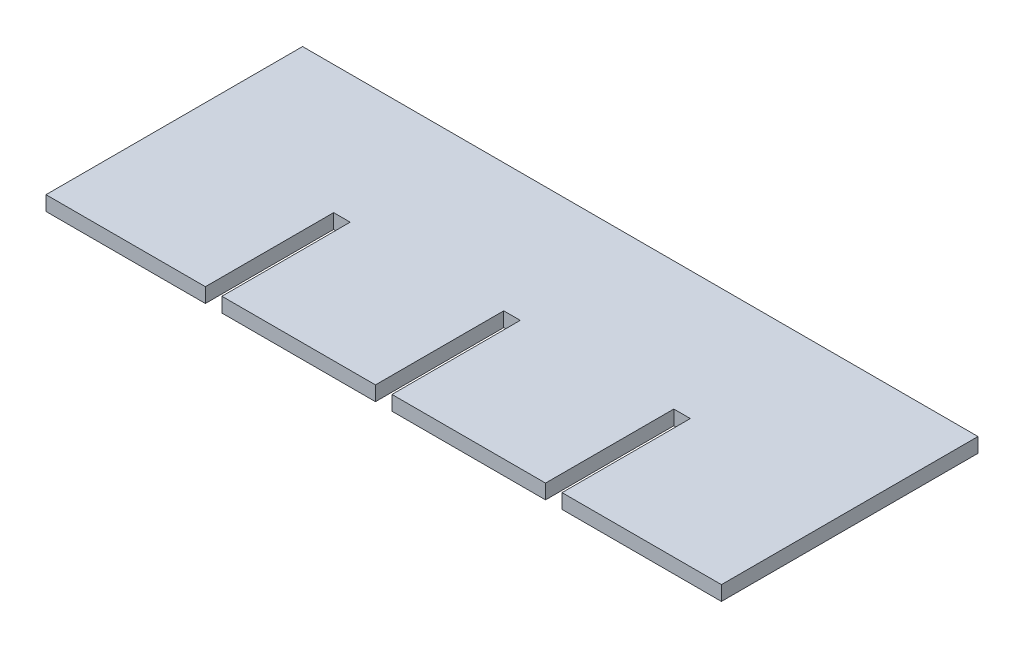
ISO-10303-21;
HEADER;
FILE_DESCRIPTION(('STEP AP214'),'2;1');
FILE_NAME('part.step','',(''),(''),'','','');
FILE_SCHEMA(('AUTOMOTIVE_DESIGN { 1 0 10303 214 1 1 1 1 }'));
ENDSEC;
DATA;
#1=APPLICATION_CONTEXT('core data for automotive mechanical design processes');
#2=APPLICATION_PROTOCOL_DEFINITION('international standard','automotive_design',2000,#1);
#3=PRODUCT_CONTEXT('',#1,'mechanical');
#4=PRODUCT('Part','Part','',(#3));
#5=PRODUCT_RELATED_PRODUCT_CATEGORY('part','',(#4));
#6=PRODUCT_DEFINITION_FORMATION('','',#4);
#7=PRODUCT_DEFINITION_CONTEXT('part definition',#1,'design');
#8=PRODUCT_DEFINITION('design','',#6,#7);
#9=PRODUCT_DEFINITION_SHAPE('','',#8);
#10=(LENGTH_UNIT() NAMED_UNIT(*) SI_UNIT(.MILLI.,.METRE.));
#11=(NAMED_UNIT(*) PLANE_ANGLE_UNIT() SI_UNIT($,.RADIAN.));
#12=(NAMED_UNIT(*) SI_UNIT($,.STERADIAN.) SOLID_ANGLE_UNIT());
#13=UNCERTAINTY_MEASURE_WITH_UNIT(LENGTH_MEASURE(1.E-05),#10,'distance_accuracy_value','');
#14=(GEOMETRIC_REPRESENTATION_CONTEXT(3) GLOBAL_UNCERTAINTY_ASSIGNED_CONTEXT((#13)) GLOBAL_UNIT_ASSIGNED_CONTEXT((#10,
#11,#12)) REPRESENTATION_CONTEXT('',''));
#15=CARTESIAN_POINT('',(0.,0.,0.));
#16=DIRECTION('',(0.,0.,1.));
#17=DIRECTION('',(1.,0.,0.));
#18=AXIS2_PLACEMENT_3D('',#15,#16,#17);
#19=CARTESIAN_POINT('',(0.,0.,26.4));
#20=DIRECTION('',(0.,0.,-1.));
#21=DIRECTION('',(-1.,0.,0.));
#22=AXIS2_PLACEMENT_3D('',#19,#20,#21);
#23=PLANE('',#22);
#24=DIRECTION('',(-1.,0.,0.));
#25=VECTOR('',#24,1.);
#26=CARTESIAN_POINT('',(-34.75,-19.25,26.4));
#27=LINE('',#26,#25);
#28=CARTESIAN_POINT('',(16.65,-19.25,26.4));
#29=VERTEX_POINT('',#28);
#30=CARTESIAN_POINT('',(0.849999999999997,-19.25,26.4));
#31=VERTEX_POINT('',#30);
#32=EDGE_CURVE('E162',#29,#31,#27,.T.);
#33=ORIENTED_EDGE('',*,*,#32,.T.);
#34=DIRECTION('',(0.,-1.,0.));
#35=VECTOR('',#34,1.);
#36=CARTESIAN_POINT('',(0.849999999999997,-5.94098050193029,26.4));
#37=LINE('',#36,#35);
#38=CARTESIAN_POINT('',(0.849999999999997,-20.75,26.4));
#39=VERTEX_POINT('',#38);
#40=EDGE_CURVE('E151',#31,#39,#37,.T.);
#41=ORIENTED_EDGE('',*,*,#40,.T.);
#42=DIRECTION('',(1.,0.,0.));
#43=VECTOR('',#42,1.);
#44=CARTESIAN_POINT('',(-34.75,-20.75,26.4));
#45=LINE('',#44,#43);
#46=CARTESIAN_POINT('',(16.65,-20.75,26.4));
#47=VERTEX_POINT('',#46);
#48=EDGE_CURVE('E57',#39,#47,#45,.T.);
#49=ORIENTED_EDGE('',*,*,#48,.T.);
#50=DIRECTION('',(0.,-1.,0.));
#51=VECTOR('',#50,1.);
#52=CARTESIAN_POINT('',(16.65,-5.94098050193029,26.4));
#53=LINE('',#52,#51);
#54=EDGE_CURVE('E295',#29,#47,#53,.T.);
#55=ORIENTED_EDGE('',*,*,#54,.F.);
#56=EDGE_LOOP('',(#33,#41,#49,#55));
#57=FACE_BOUND('',#56,.T.);
#58=ADVANCED_FACE('F34',(#57),#23,.F.);
#59=CARTESIAN_POINT('',(34.75,-19.25,26.4));
#60=VERTEX_POINT('',#59);
#61=CARTESIAN_POINT('',(18.35,-19.25,26.4));
#62=VERTEX_POINT('',#61);
#63=EDGE_CURVE('E222',#60,#62,#27,.T.);
#64=ORIENTED_EDGE('',*,*,#63,.T.);
#65=DIRECTION('',(0.,-1.,0.));
#66=VECTOR('',#65,1.);
#67=CARTESIAN_POINT('',(18.35,-5.94098050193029,26.4));
#68=LINE('',#67,#66);
#69=CARTESIAN_POINT('',(18.35,-20.75,26.4));
#70=VERTEX_POINT('',#69);
#71=EDGE_CURVE('E291',#62,#70,#68,.T.);
#72=ORIENTED_EDGE('',*,*,#71,.T.);
#73=CARTESIAN_POINT('',(34.75,-20.75,26.4));
#74=VERTEX_POINT('',#73);
#75=EDGE_CURVE('E171',#70,#74,#45,.T.);
#76=ORIENTED_EDGE('',*,*,#75,.T.);
#77=DIRECTION('',(0.,1.,0.));
#78=VECTOR('',#77,1.);
#79=CARTESIAN_POINT('',(34.75,-19.25,26.4));
#80=LINE('',#79,#78);
#81=EDGE_CURVE('E179',#74,#60,#80,.T.);
#82=ORIENTED_EDGE('',*,*,#81,.T.);
#83=EDGE_LOOP('',(#64,#72,#76,#82));
#84=FACE_BOUND('',#83,.T.);
#85=ADVANCED_FACE('F242',(#84),#23,.F.);
#86=CARTESIAN_POINT('',(-16.65,-20.75,26.4));
#87=VERTEX_POINT('',#86);
#88=CARTESIAN_POINT('',(-0.850000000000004,-20.75,26.4));
#89=VERTEX_POINT('',#88);
#90=EDGE_CURVE('E170',#87,#89,#45,.T.);
#91=ORIENTED_EDGE('',*,*,#90,.T.);
#92=DIRECTION('',(0.,-1.,0.));
#93=VECTOR('',#92,1.);
#94=CARTESIAN_POINT('',(-0.850000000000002,-5.94098050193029,26.4));
#95=LINE('',#94,#93);
#96=CARTESIAN_POINT('',(-0.850000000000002,-19.25,26.4));
#97=VERTEX_POINT('',#96);
#98=EDGE_CURVE('E49',#97,#89,#95,.T.);
#99=ORIENTED_EDGE('',*,*,#98,.F.);
#100=CARTESIAN_POINT('',(-16.65,-19.25,26.4));
#101=VERTEX_POINT('',#100);
#102=EDGE_CURVE('E227',#97,#101,#27,.T.);
#103=ORIENTED_EDGE('',*,*,#102,.T.);
#104=DIRECTION('',(0.,-1.,0.));
#105=VECTOR('',#104,1.);
#106=CARTESIAN_POINT('',(-16.65,-5.94098050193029,26.4));
#107=LINE('',#106,#105);
#108=EDGE_CURVE('E264',#101,#87,#107,.T.);
#109=ORIENTED_EDGE('',*,*,#108,.T.);
#110=EDGE_LOOP('',(#91,#99,#103,#109));
#111=FACE_BOUND('',#110,.T.);
#112=ADVANCED_FACE('F240',(#111),#23,.F.);
#113=CARTESIAN_POINT('',(-34.75,-19.25,26.4));
#114=DIRECTION('',(0.,-1.,0.));
#115=DIRECTION('',(0.,0.,-1.));
#116=AXIS2_PLACEMENT_3D('',#113,#114,#115);
#117=PLANE('',#116);
#118=DIRECTION('',(-1.,0.,0.));
#119=VECTOR('',#118,1.);
#120=CARTESIAN_POINT('',(0.85,-19.25,13.2));
#121=LINE('',#120,#119);
#122=CARTESIAN_POINT('',(0.85,-19.25,13.2));
#123=VERTEX_POINT('',#122);
#124=CARTESIAN_POINT('',(-0.85,-19.25,13.2));
#125=VERTEX_POINT('',#124);
#126=EDGE_CURVE('E354',#123,#125,#121,.T.);
#127=ORIENTED_EDGE('',*,*,#126,.F.);
#128=DIRECTION('',(0.,0.,-1.));
#129=VECTOR('',#128,1.);
#130=CARTESIAN_POINT('',(0.849999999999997,-19.25,26.4));
#131=LINE('',#130,#129);
#132=EDGE_CURVE('E286',#31,#123,#131,.T.);
#133=ORIENTED_EDGE('',*,*,#132,.F.);
#134=ORIENTED_EDGE('',*,*,#32,.F.);
#135=DIRECTION('',(0.,0.,1.));
#136=VECTOR('',#135,1.);
#137=CARTESIAN_POINT('',(16.65,-19.25,26.4));
#138=LINE('',#137,#136);
#139=CARTESIAN_POINT('',(16.65,-19.25,13.2));
#140=VERTEX_POINT('',#139);
#141=EDGE_CURVE('E278',#140,#29,#138,.T.);
#142=ORIENTED_EDGE('',*,*,#141,.F.);
#143=DIRECTION('',(-1.,0.,0.));
#144=VECTOR('',#143,1.);
#145=CARTESIAN_POINT('',(18.35,-19.25,13.2));
#146=LINE('',#145,#144);
#147=CARTESIAN_POINT('',(18.35,-19.25,13.2));
#148=VERTEX_POINT('',#147);
#149=EDGE_CURVE('E280',#148,#140,#146,.T.);
#150=ORIENTED_EDGE('',*,*,#149,.F.);
#151=DIRECTION('',(0.,0.,-1.));
#152=VECTOR('',#151,1.);
#153=CARTESIAN_POINT('',(18.35,-19.25,26.4));
#154=LINE('',#153,#152);
#155=EDGE_CURVE('E224',#62,#148,#154,.T.);
#156=ORIENTED_EDGE('',*,*,#155,.F.);
#157=ORIENTED_EDGE('',*,*,#63,.F.);
#158=DIRECTION('',(0.,0.,-1.));
#159=VECTOR('',#158,1.);
#160=CARTESIAN_POINT('',(34.75,-19.25,26.4));
#161=LINE('',#160,#159);
#162=CARTESIAN_POINT('',(34.75,-19.25,0.));
#163=VERTEX_POINT('',#162);
#164=EDGE_CURVE('E183',#60,#163,#161,.T.);
#165=ORIENTED_EDGE('',*,*,#164,.T.);
#166=DIRECTION('',(-1.,0.,0.));
#167=VECTOR('',#166,1.);
#168=CARTESIAN_POINT('',(-34.75,-19.25,0.));
#169=LINE('',#168,#167);
#170=CARTESIAN_POINT('',(-34.75,-19.25,0.));
#171=VERTEX_POINT('',#170);
#172=EDGE_CURVE('E192',#163,#171,#169,.T.);
#173=ORIENTED_EDGE('',*,*,#172,.T.);
#174=DIRECTION('',(0.,0.,-1.));
#175=VECTOR('',#174,1.);
#176=CARTESIAN_POINT('',(-34.75,-19.25,26.4));
#177=LINE('',#176,#175);
#178=CARTESIAN_POINT('',(-34.75,-19.25,26.4));
#179=VERTEX_POINT('',#178);
#180=EDGE_CURVE('E11',#179,#171,#177,.T.);
#181=ORIENTED_EDGE('',*,*,#180,.F.);
#182=CARTESIAN_POINT('',(-18.35,-19.25,26.4));
#183=VERTEX_POINT('',#182);
#184=EDGE_CURVE('E201',#183,#179,#27,.T.);
#185=ORIENTED_EDGE('',*,*,#184,.F.);
#186=DIRECTION('',(0.,0.,1.));
#187=VECTOR('',#186,1.);
#188=CARTESIAN_POINT('',(-18.35,-19.25,13.2));
#189=LINE('',#188,#187);
#190=CARTESIAN_POINT('',(-18.35,-19.25,13.2));
#191=VERTEX_POINT('',#190);
#192=EDGE_CURVE('E298',#191,#183,#189,.T.);
#193=ORIENTED_EDGE('',*,*,#192,.F.);
#194=DIRECTION('',(-1.,0.,0.));
#195=VECTOR('',#194,1.);
#196=CARTESIAN_POINT('',(-18.35,-19.25,13.2));
#197=LINE('',#196,#195);
#198=CARTESIAN_POINT('',(-16.65,-19.25,13.2));
#199=VERTEX_POINT('',#198);
#200=EDGE_CURVE('E300',#199,#191,#197,.T.);
#201=ORIENTED_EDGE('',*,*,#200,.F.);
#202=DIRECTION('',(0.,0.,-1.));
#203=VECTOR('',#202,1.);
#204=CARTESIAN_POINT('',(-16.65,-19.25,13.2));
#205=LINE('',#204,#203);
#206=EDGE_CURVE('E196',#101,#199,#205,.T.);
#207=ORIENTED_EDGE('',*,*,#206,.F.);
#208=ORIENTED_EDGE('',*,*,#102,.F.);
#209=DIRECTION('',(0.,0.,1.));
#210=VECTOR('',#209,1.);
#211=CARTESIAN_POINT('',(-0.850000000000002,-19.25,26.4));
#212=LINE('',#211,#210);
#213=EDGE_CURVE('E274',#125,#97,#212,.T.);
#214=ORIENTED_EDGE('',*,*,#213,.F.);
#215=EDGE_LOOP('',(#127,#133,#134,#142,#150,#156,#157,#165,#173,#181,#185,#193,#201,#207,#208,#214));
#216=FACE_BOUND('',#215,.T.);
#217=ADVANCED_FACE('F36',(#216),#117,.F.);
#218=CARTESIAN_POINT('',(-34.75,-19.25,26.4));
#219=DIRECTION('',(1.,0.,0.));
#220=DIRECTION('',(0.,0.,-1.));
#221=AXIS2_PLACEMENT_3D('',#218,#219,#220);
#222=PLANE('',#221);
#223=DIRECTION('',(0.,-1.,0.));
#224=VECTOR('',#223,1.);
#225=CARTESIAN_POINT('',(-34.75,-19.25,0.));
#226=LINE('',#225,#224);
#227=CARTESIAN_POINT('',(-34.75,-20.75,0.));
#228=VERTEX_POINT('',#227);
#229=EDGE_CURVE('E195',#171,#228,#226,.T.);
#230=ORIENTED_EDGE('',*,*,#229,.T.);
#231=DIRECTION('',(0.,0.,-1.));
#232=VECTOR('',#231,1.);
#233=CARTESIAN_POINT('',(-34.75,-20.75,26.4));
#234=LINE('',#233,#232);
#235=CARTESIAN_POINT('',(-34.75,-20.75,26.4));
#236=VERTEX_POINT('',#235);
#237=EDGE_CURVE('E42',#236,#228,#234,.T.);
#238=ORIENTED_EDGE('',*,*,#237,.F.);
#239=DIRECTION('',(0.,-1.,0.));
#240=VECTOR('',#239,1.);
#241=CARTESIAN_POINT('',(-34.75,-19.25,26.4));
#242=LINE('',#241,#240);
#243=EDGE_CURVE('E175',#179,#236,#242,.T.);
#244=ORIENTED_EDGE('',*,*,#243,.F.);
#245=ORIENTED_EDGE('',*,*,#180,.T.);
#246=EDGE_LOOP('',(#230,#238,#244,#245));
#247=FACE_BOUND('',#246,.T.);
#248=ADVANCED_FACE('F233',(#247),#222,.F.);
#249=CARTESIAN_POINT('',(-34.75,-20.75,26.4));
#250=DIRECTION('',(0.,1.,0.));
#251=DIRECTION('',(0.,0.,1.));
#252=AXIS2_PLACEMENT_3D('',#249,#250,#251);
#253=PLANE('',#252);
#254=ORIENTED_EDGE('',*,*,#48,.F.);
#255=DIRECTION('',(0.,0.,1.));
#256=VECTOR('',#255,1.);
#257=CARTESIAN_POINT('',(0.849999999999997,-20.75,26.4));
#258=LINE('',#257,#256);
#259=CARTESIAN_POINT('',(0.85,-20.75,13.2));
#260=VERTEX_POINT('',#259);
#261=EDGE_CURVE('E149',#260,#39,#258,.T.);
#262=ORIENTED_EDGE('',*,*,#261,.F.);
#263=DIRECTION('',(1.,0.,0.));
#264=VECTOR('',#263,1.);
#265=CARTESIAN_POINT('',(0.85,-20.75,13.2));
#266=LINE('',#265,#264);
#267=CARTESIAN_POINT('',(-0.85,-20.75,13.2));
#268=VERTEX_POINT('',#267);
#269=EDGE_CURVE('E163',#268,#260,#266,.T.);
#270=ORIENTED_EDGE('',*,*,#269,.F.);
#271=DIRECTION('',(0.,0.,-1.));
#272=VECTOR('',#271,1.);
#273=CARTESIAN_POINT('',(-0.850000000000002,-20.75,26.4));
#274=LINE('',#273,#272);
#275=EDGE_CURVE('E158',#89,#268,#274,.T.);
#276=ORIENTED_EDGE('',*,*,#275,.F.);
#277=ORIENTED_EDGE('',*,*,#90,.F.);
#278=DIRECTION('',(0.,0.,1.));
#279=VECTOR('',#278,1.);
#280=CARTESIAN_POINT('',(-16.65,-20.75,13.2));
#281=LINE('',#280,#279);
#282=CARTESIAN_POINT('',(-16.65,-20.75,13.2));
#283=VERTEX_POINT('',#282);
#284=EDGE_CURVE('E267',#283,#87,#281,.T.);
#285=ORIENTED_EDGE('',*,*,#284,.F.);
#286=DIRECTION('',(1.,0.,0.));
#287=VECTOR('',#286,1.);
#288=CARTESIAN_POINT('',(-18.35,-20.75,13.2));
#289=LINE('',#288,#287);
#290=CARTESIAN_POINT('',(-18.35,-20.75,13.2));
#291=VERTEX_POINT('',#290);
#292=EDGE_CURVE('E308',#291,#283,#289,.T.);
#293=ORIENTED_EDGE('',*,*,#292,.F.);
#294=DIRECTION('',(0.,0.,-1.));
#295=VECTOR('',#294,1.);
#296=CARTESIAN_POINT('',(-18.35,-20.75,13.2));
#297=LINE('',#296,#295);
#298=CARTESIAN_POINT('',(-18.35,-20.75,26.4));
#299=VERTEX_POINT('',#298);
#300=EDGE_CURVE('E305',#299,#291,#297,.T.);
#301=ORIENTED_EDGE('',*,*,#300,.F.);
#302=EDGE_CURVE('E173',#236,#299,#45,.T.);
#303=ORIENTED_EDGE('',*,*,#302,.F.);
#304=ORIENTED_EDGE('',*,*,#237,.T.);
#305=DIRECTION('',(1.,0.,0.));
#306=VECTOR('',#305,1.);
#307=CARTESIAN_POINT('',(-34.75,-20.75,0.));
#308=LINE('',#307,#306);
#309=CARTESIAN_POINT('',(34.75,-20.75,0.));
#310=VERTEX_POINT('',#309);
#311=EDGE_CURVE('E198',#228,#310,#308,.T.);
#312=ORIENTED_EDGE('',*,*,#311,.T.);
#313=DIRECTION('',(0.,0.,-1.));
#314=VECTOR('',#313,1.);
#315=CARTESIAN_POINT('',(34.75,-20.75,26.4));
#316=LINE('',#315,#314);
#317=EDGE_CURVE('E189',#74,#310,#316,.T.);
#318=ORIENTED_EDGE('',*,*,#317,.F.);
#319=ORIENTED_EDGE('',*,*,#75,.F.);
#320=DIRECTION('',(0.,0.,1.));
#321=VECTOR('',#320,1.);
#322=CARTESIAN_POINT('',(18.35,-20.75,26.4));
#323=LINE('',#322,#321);
#324=CARTESIAN_POINT('',(18.35,-20.75,13.2));
#325=VERTEX_POINT('',#324);
#326=EDGE_CURVE('E284',#325,#70,#323,.T.);
#327=ORIENTED_EDGE('',*,*,#326,.F.);
#328=DIRECTION('',(1.,0.,0.));
#329=VECTOR('',#328,1.);
#330=CARTESIAN_POINT('',(18.35,-20.75,13.2));
#331=LINE('',#330,#329);
#332=CARTESIAN_POINT('',(16.65,-20.75,13.2));
#333=VERTEX_POINT('',#332);
#334=EDGE_CURVE('E288',#333,#325,#331,.T.);
#335=ORIENTED_EDGE('',*,*,#334,.F.);
#336=DIRECTION('',(0.,0.,-1.));
#337=VECTOR('',#336,1.);
#338=CARTESIAN_POINT('',(16.65,-20.75,26.4));
#339=LINE('',#338,#337);
#340=EDGE_CURVE('E169',#47,#333,#339,.T.);
#341=ORIENTED_EDGE('',*,*,#340,.F.);
#342=EDGE_LOOP('',(#254,#262,#270,#276,#277,#285,#293,#301,#303,#304,#312,#318,#319,#327,#335,#341));
#343=FACE_BOUND('',#342,.T.);
#344=ADVANCED_FACE('F166',(#343),#253,.F.);
#345=CARTESIAN_POINT('',(34.75,-19.25,26.4));
#346=DIRECTION('',(-1.,0.,0.));
#347=DIRECTION('',(0.,-1.,0.));
#348=AXIS2_PLACEMENT_3D('',#345,#346,#347);
#349=PLANE('',#348);
#350=DIRECTION('',(0.,1.,0.));
#351=VECTOR('',#350,1.);
#352=CARTESIAN_POINT('',(34.75,-19.25,0.));
#353=LINE('',#352,#351);
#354=EDGE_CURVE('E200',#310,#163,#353,.T.);
#355=ORIENTED_EDGE('',*,*,#354,.T.);
#356=ORIENTED_EDGE('',*,*,#164,.F.);
#357=ORIENTED_EDGE('',*,*,#81,.F.);
#358=ORIENTED_EDGE('',*,*,#317,.T.);
#359=EDGE_LOOP('',(#355,#356,#357,#358));
#360=FACE_BOUND('',#359,.T.);
#361=ADVANCED_FACE('F216',(#360),#349,.F.);
#362=ORIENTED_EDGE('',*,*,#302,.T.);
#363=DIRECTION('',(0.,-1.,0.));
#364=VECTOR('',#363,1.);
#365=CARTESIAN_POINT('',(-18.35,-5.94098050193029,26.4));
#366=LINE('',#365,#364);
#367=EDGE_CURVE('E231',#183,#299,#366,.T.);
#368=ORIENTED_EDGE('',*,*,#367,.F.);
#369=ORIENTED_EDGE('',*,*,#184,.T.);
#370=ORIENTED_EDGE('',*,*,#243,.T.);
#371=EDGE_LOOP('',(#362,#368,#369,#370));
#372=FACE_BOUND('',#371,.T.);
#373=ADVANCED_FACE('F230',(#372),#23,.F.);
#374=CARTESIAN_POINT('',(0.,0.,0.));
#375=DIRECTION('',(0.,0.,-1.));
#376=DIRECTION('',(-1.,0.,0.));
#377=AXIS2_PLACEMENT_3D('',#374,#375,#376);
#378=PLANE('',#377);
#379=ORIENTED_EDGE('',*,*,#172,.F.);
#380=ORIENTED_EDGE('',*,*,#354,.F.);
#381=ORIENTED_EDGE('',*,*,#311,.F.);
#382=ORIENTED_EDGE('',*,*,#229,.F.);
#383=EDGE_LOOP('',(#379,#380,#381,#382));
#384=FACE_BOUND('',#383,.T.);
#385=ADVANCED_FACE('F214',(#384),#378,.T.);
#386=CARTESIAN_POINT('',(-16.65,-5.94098050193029,13.2));
#387=DIRECTION('',(1.,0.,0.));
#388=DIRECTION('',(0.,0.,-1.));
#389=AXIS2_PLACEMENT_3D('',#386,#387,#388);
#390=PLANE('',#389);
#391=ORIENTED_EDGE('',*,*,#206,.T.);
#392=DIRECTION('',(0.,-1.,0.));
#393=VECTOR('',#392,1.);
#394=CARTESIAN_POINT('',(-16.65,-5.94098050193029,13.2));
#395=LINE('',#394,#393);
#396=EDGE_CURVE('E301',#199,#283,#395,.T.);
#397=ORIENTED_EDGE('',*,*,#396,.T.);
#398=ORIENTED_EDGE('',*,*,#284,.T.);
#399=ORIENTED_EDGE('',*,*,#108,.F.);
#400=EDGE_LOOP('',(#391,#397,#398,#399));
#401=FACE_BOUND('',#400,.T.);
#402=ADVANCED_FACE('F254',(#401),#390,.F.);
#403=CARTESIAN_POINT('',(-18.35,-5.94098050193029,13.2));
#404=DIRECTION('',(0.,0.,-1.));
#405=DIRECTION('',(-1.,0.,0.));
#406=AXIS2_PLACEMENT_3D('',#403,#404,#405);
#407=PLANE('',#406);
#408=ORIENTED_EDGE('',*,*,#200,.T.);
#409=DIRECTION('',(0.,-1.,0.));
#410=VECTOR('',#409,1.);
#411=CARTESIAN_POINT('',(-18.35,-5.94098050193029,13.2));
#412=LINE('',#411,#410);
#413=EDGE_CURVE('E312',#191,#291,#412,.T.);
#414=ORIENTED_EDGE('',*,*,#413,.T.);
#415=ORIENTED_EDGE('',*,*,#292,.T.);
#416=ORIENTED_EDGE('',*,*,#396,.F.);
#417=EDGE_LOOP('',(#408,#414,#415,#416));
#418=FACE_BOUND('',#417,.T.);
#419=ADVANCED_FACE('F319',(#418),#407,.F.);
#420=CARTESIAN_POINT('',(-18.35,-5.94098050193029,13.2));
#421=DIRECTION('',(-1.,0.,0.));
#422=DIRECTION('',(0.,0.,1.));
#423=AXIS2_PLACEMENT_3D('',#420,#421,#422);
#424=PLANE('',#423);
#425=ORIENTED_EDGE('',*,*,#192,.T.);
#426=ORIENTED_EDGE('',*,*,#367,.T.);
#427=ORIENTED_EDGE('',*,*,#300,.T.);
#428=ORIENTED_EDGE('',*,*,#413,.F.);
#429=EDGE_LOOP('',(#425,#426,#427,#428));
#430=FACE_BOUND('',#429,.T.);
#431=ADVANCED_FACE('F315',(#430),#424,.F.);
#432=CARTESIAN_POINT('',(18.35,-5.94098050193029,26.4));
#433=DIRECTION('',(1.,0.,0.));
#434=DIRECTION('',(0.,0.,-1.));
#435=AXIS2_PLACEMENT_3D('',#432,#433,#434);
#436=PLANE('',#435);
#437=ORIENTED_EDGE('',*,*,#155,.T.);
#438=DIRECTION('',(0.,-1.,0.));
#439=VECTOR('',#438,1.);
#440=CARTESIAN_POINT('',(18.35,-5.94098050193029,13.2));
#441=LINE('',#440,#439);
#442=EDGE_CURVE('E281',#148,#325,#441,.T.);
#443=ORIENTED_EDGE('',*,*,#442,.T.);
#444=ORIENTED_EDGE('',*,*,#326,.T.);
#445=ORIENTED_EDGE('',*,*,#71,.F.);
#446=EDGE_LOOP('',(#437,#443,#444,#445));
#447=FACE_BOUND('',#446,.T.);
#448=ADVANCED_FACE('F331',(#447),#436,.F.);
#449=CARTESIAN_POINT('',(18.35,-5.94098050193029,13.2));
#450=DIRECTION('',(0.,0.,-1.));
#451=DIRECTION('',(-1.,0.,0.));
#452=AXIS2_PLACEMENT_3D('',#449,#450,#451);
#453=PLANE('',#452);
#454=ORIENTED_EDGE('',*,*,#149,.T.);
#455=DIRECTION('',(0.,-1.,0.));
#456=VECTOR('',#455,1.);
#457=CARTESIAN_POINT('',(16.65,-5.94098050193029,13.2));
#458=LINE('',#457,#456);
#459=EDGE_CURVE('E293',#140,#333,#458,.T.);
#460=ORIENTED_EDGE('',*,*,#459,.T.);
#461=ORIENTED_EDGE('',*,*,#334,.T.);
#462=ORIENTED_EDGE('',*,*,#442,.F.);
#463=EDGE_LOOP('',(#454,#460,#461,#462));
#464=FACE_BOUND('',#463,.T.);
#465=ADVANCED_FACE('F335',(#464),#453,.F.);
#466=CARTESIAN_POINT('',(16.65,-5.94098050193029,26.4));
#467=DIRECTION('',(-1.,0.,0.));
#468=DIRECTION('',(0.,0.,1.));
#469=AXIS2_PLACEMENT_3D('',#466,#467,#468);
#470=PLANE('',#469);
#471=ORIENTED_EDGE('',*,*,#141,.T.);
#472=ORIENTED_EDGE('',*,*,#54,.T.);
#473=ORIENTED_EDGE('',*,*,#340,.T.);
#474=ORIENTED_EDGE('',*,*,#459,.F.);
#475=EDGE_LOOP('',(#471,#472,#473,#474));
#476=FACE_BOUND('',#475,.T.);
#477=ADVANCED_FACE('F337',(#476),#470,.F.);
#478=CARTESIAN_POINT('',(0.849999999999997,-5.94098050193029,26.4));
#479=DIRECTION('',(1.,0.,0.));
#480=DIRECTION('',(0.,0.,-1.));
#481=AXIS2_PLACEMENT_3D('',#478,#479,#480);
#482=PLANE('',#481);
#483=ORIENTED_EDGE('',*,*,#132,.T.);
#484=DIRECTION('',(0.,-1.,0.));
#485=VECTOR('',#484,1.);
#486=CARTESIAN_POINT('',(0.85,-5.94098050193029,13.2));
#487=LINE('',#486,#485);
#488=EDGE_CURVE('E154',#123,#260,#487,.T.);
#489=ORIENTED_EDGE('',*,*,#488,.T.);
#490=ORIENTED_EDGE('',*,*,#261,.T.);
#491=ORIENTED_EDGE('',*,*,#40,.F.);
#492=EDGE_LOOP('',(#483,#489,#490,#491));
#493=FACE_BOUND('',#492,.T.);
#494=ADVANCED_FACE('F150',(#493),#482,.F.);
#495=CARTESIAN_POINT('',(0.85,-5.94098050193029,13.2));
#496=DIRECTION('',(0.,0.,-1.));
#497=DIRECTION('',(-1.,0.,0.));
#498=AXIS2_PLACEMENT_3D('',#495,#496,#497);
#499=PLANE('',#498);
#500=ORIENTED_EDGE('',*,*,#126,.T.);
#501=DIRECTION('',(0.,-1.,0.));
#502=VECTOR('',#501,1.);
#503=CARTESIAN_POINT('',(-0.85,-5.94098050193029,13.2));
#504=LINE('',#503,#502);
#505=EDGE_CURVE('E275',#125,#268,#504,.T.);
#506=ORIENTED_EDGE('',*,*,#505,.T.);
#507=ORIENTED_EDGE('',*,*,#269,.T.);
#508=ORIENTED_EDGE('',*,*,#488,.F.);
#509=EDGE_LOOP('',(#500,#506,#507,#508));
#510=FACE_BOUND('',#509,.T.);
#511=ADVANCED_FACE('F346',(#510),#499,.F.);
#512=CARTESIAN_POINT('',(-0.850000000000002,-5.94098050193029,26.4));
#513=DIRECTION('',(-1.,0.,0.));
#514=DIRECTION('',(0.,0.,1.));
#515=AXIS2_PLACEMENT_3D('',#512,#513,#514);
#516=PLANE('',#515);
#517=ORIENTED_EDGE('',*,*,#213,.T.);
#518=ORIENTED_EDGE('',*,*,#98,.T.);
#519=ORIENTED_EDGE('',*,*,#275,.T.);
#520=ORIENTED_EDGE('',*,*,#505,.F.);
#521=EDGE_LOOP('',(#517,#518,#519,#520));
#522=FACE_BOUND('',#521,.T.);
#523=ADVANCED_FACE('F347',(#522),#516,.F.);
#524=CLOSED_SHELL('',(#58,#85,#112,#217,#248,#344,#361,#373,#385,#402,#419,#431,#448,#465,#477,
#494,#511,#523));
#525=MANIFOLD_SOLID_BREP('B2',#524);
#526=ADVANCED_BREP_SHAPE_REPRESENTATION('',(#18,#525),#14);
#527=SHAPE_DEFINITION_REPRESENTATION(#9,#526);
ENDSEC;
END-ISO-10303-21;
